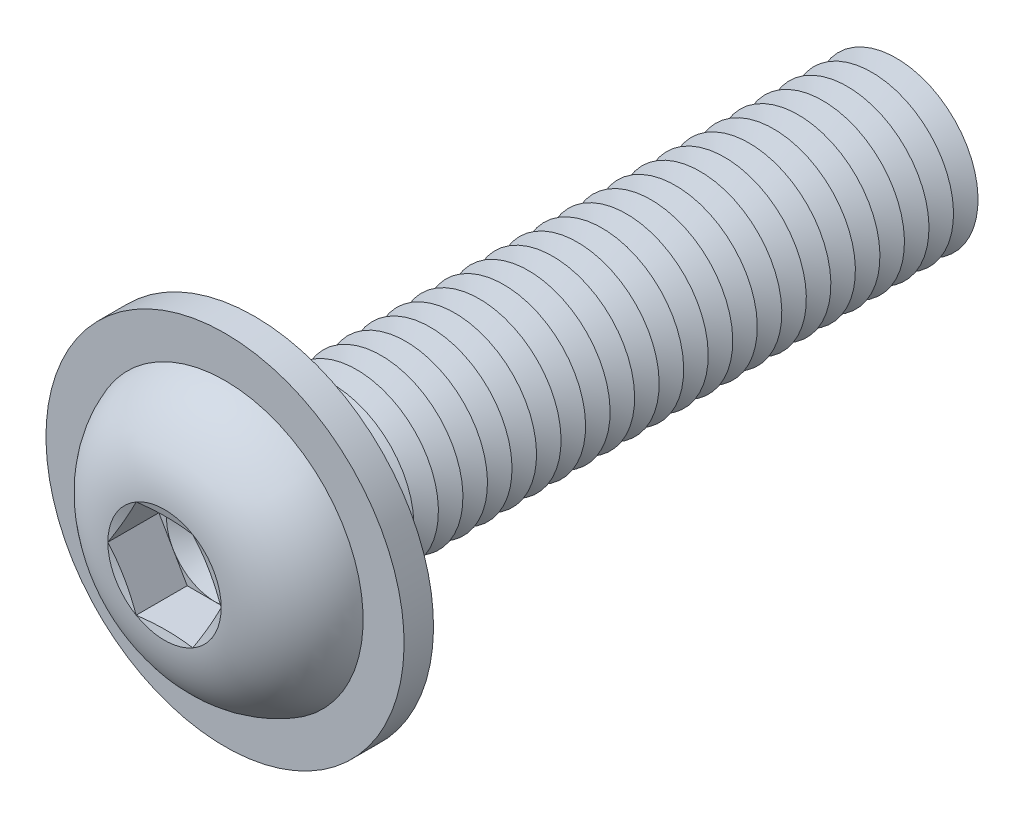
from build123d import *

# Parameters (mm, degrees)
FILLET1_R           = 0.75
LPATTERN1_COUNT     = 26
LPATTERN1_PITCH     = 1.5
CUT_EXTRUDE1_DEPTH  = 3.12
SKETCH5_R           = 10.95
SKETCH5_R_2         = 5.75
BOSS_EXTRUDE1_DEPTH = 1.8


with BuildPart() as part:
    # Sketch1 → Revolve1 (revolve)
    with BuildSketch(Plane(origin=(0, 0, 0), x_dir=(0, 0, -1), z_dir=(1, 0, 0))):
        with BuildLine():
            Line((0, 5), (0, 8.75))
            ThreePointArc((0, 8.75), (-3.814142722, 7.21429474), (-5.5, 3.4641))
            Line((-5.5, 3.4641), (-5.035898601, 1.73205))
            Line((-5.035898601, 1.73205), (-5.5, 1.73205))
            Line((-5.5, 1.73205), (-5.5, 0))
            Line((-5.5, 0), (40, 0))
            Line((40, 0), (40, 5))
            Line((40, 5), (0, 5))
        make_face()
    revolve(axis=Axis((0, 0, -40), (0, 0, 1)))

    # Fillet1
    fillet1_edges = [part.edges().sort_by_distance(p)[0] for p in [
        (0, -5, 0),
    ]]
    fillet(fillet1_edges, radius=FILLET1_R)

    # Sketch2 → Cut-Revolve1 (revolve, cut)
    with BuildSketch(Plane(origin=(0, 0, 0), x_dir=(0, 0, -1), z_dir=(1, 0, 0))):
        Polygon((39.25, 5), (40.75, 5), (40, 3.700961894), align=None)
    cut_revolve1 = revolve(axis=Axis((0, 0, -40), (0, 0, -1)), mode=Mode.SUBTRACT)

    # LPattern1: Cut-Revolve1 ×26
    with Locations(*[(0, 0, i * LPATTERN1_PITCH) for i in range(1, LPATTERN1_COUNT)]):
        add(cut_revolve1, mode=Mode.SUBTRACT)

    # Sketch3 → Cut-Extrude1 (cut)
    with BuildSketch(Plane.XY.offset(5.5)):
        Polygon((1.73205, 2.999998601), (-1.73205, 2.999998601), (-3.4641, 0), (-1.73205, -2.999998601), (1.73205, -2.999998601), (3.4641, 0), align=None)
    extrude(amount=-CUT_EXTRUDE1_DEPTH, mode=Mode.SUBTRACT)

    # Cut-Extrude2 cone 1 section (on through the dimple's axis) → Cut-Extrude2 (revolve, cut)
    with BuildSketch(Plane(origin=(0, 0, 2.38), x_dir=(0, -1, 0), z_dir=(1, 0, 0))):
        Polygon((0, 0), (2.999998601, 0), (0, 1.73205), align=None)
    revolve(axis=Axis((0, 0, 2.38), (0, 0, -1)), mode=Mode.SUBTRACT)

    # Sketch5 → Boss-Extrude1 (add)
    with BuildSketch(Plane(origin=(0, 0, 0), x_dir=(-1, 0, 0), z_dir=(0, 0, -1))):
        with Locations(Location((0, 0, 0), (0, 0, 90))):
            Circle(SKETCH5_R)
        Circle(SKETCH5_R_2, mode=Mode.SUBTRACT)
    extrude(amount=-BOSS_EXTRUDE1_DEPTH)


solid = part.part
